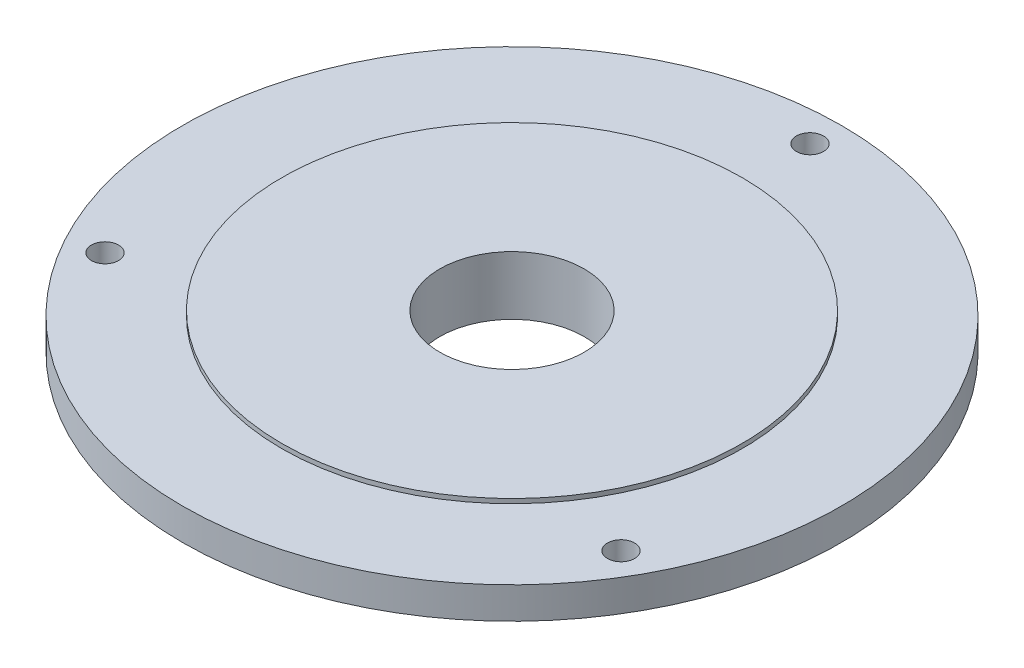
from build123d import *

# Parameters (mm, degrees)
SCHIZZO2_R               = 1.5
TAGLIO_ESTRUSIONE1_DEPTH = 52.966335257


with BuildPart() as part:
    # Schizzo1 → Rivoluzione1 (revolve)
    with BuildSketch(Plane.XY, mode=Mode.PRIVATE) as rivoluzione1_sk:
        Polygon((36.5, 37.885931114), (36.5, 34.385931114), (14.25, 34.385931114), (14.25, 31.885931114), (8, 31.885931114), (8, 38.385931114), (25.5, 38.385931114), (25.5, 37.885931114), align=None)
    revolve(rivoluzione1_sk.sketch.rotate(Axis((0, 0, 0), (0, 1, 0)), 90), axis=Axis((0, 0, 0), (0, 1, 0)))

    # Schizzo2 → Taglio-Estrusione1 (cut, through all)
    with BuildSketch(Plane(origin=(0, 37.885931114, 0), x_dir=(1, 0, 0), z_dir=(0, 1, 0))):
        with Locations(Location((0, 33, 0), (0, 0, 270))):
            Circle(SCHIZZO2_R)
        with Locations(Location((28.578838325, -16.5, 0), (0, 0, 270))):
            Circle(SCHIZZO2_R)
        with Locations(Location((-28.578838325, -16.5, 0), (0, 0, 270))):
            Circle(SCHIZZO2_R)
    extrude(amount=-TAGLIO_ESTRUSIONE1_DEPTH, mode=Mode.SUBTRACT)


solid = part.part
